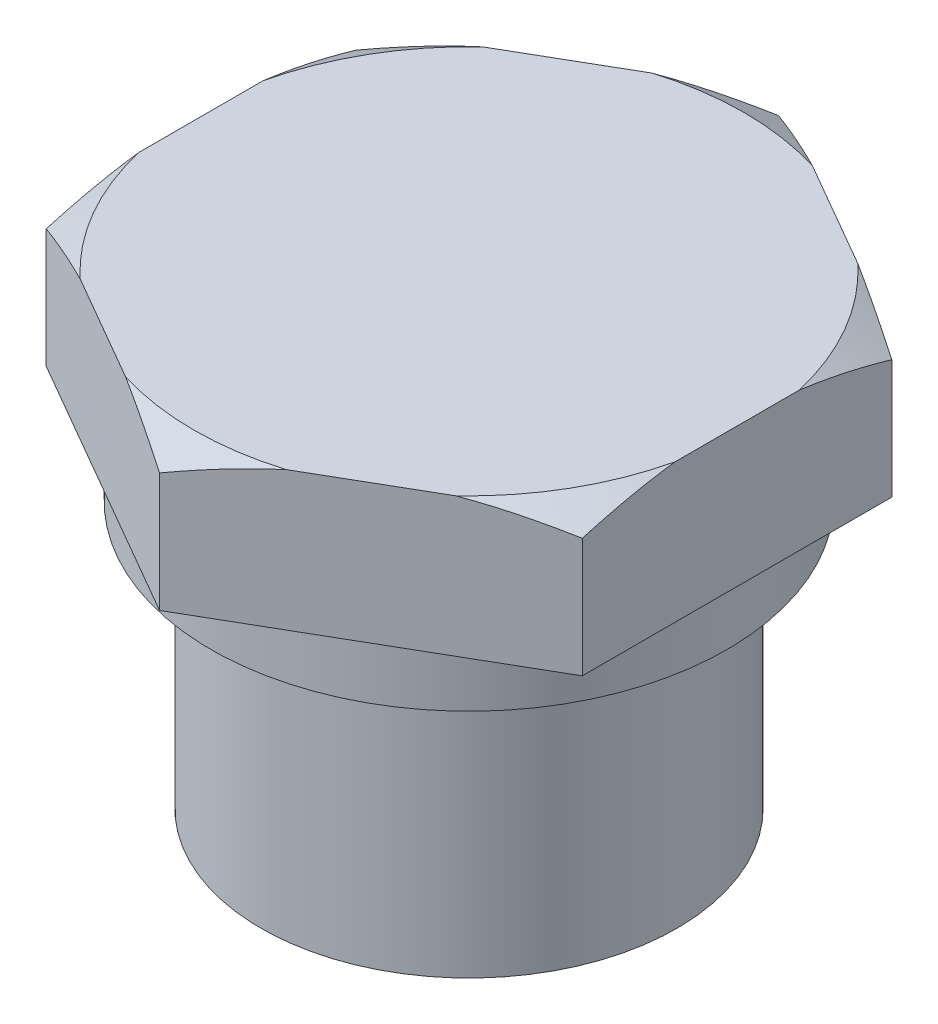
ISO-10303-21;
HEADER;
FILE_DESCRIPTION(('STEP AP214'),'2;1');
FILE_NAME('part.step','',(''),(''),'','','');
FILE_SCHEMA(('AUTOMOTIVE_DESIGN { 1 0 10303 214 1 1 1 1 }'));
ENDSEC;
DATA;
#1=APPLICATION_CONTEXT('core data for automotive mechanical design processes');
#2=APPLICATION_PROTOCOL_DEFINITION('international standard','automotive_design',2000,#1);
#3=PRODUCT_CONTEXT('',#1,'mechanical');
#4=PRODUCT('Part','Part','',(#3));
#5=PRODUCT_RELATED_PRODUCT_CATEGORY('part','',(#4));
#6=PRODUCT_DEFINITION_FORMATION('','',#4);
#7=PRODUCT_DEFINITION_CONTEXT('part definition',#1,'design');
#8=PRODUCT_DEFINITION('design','',#6,#7);
#9=PRODUCT_DEFINITION_SHAPE('','',#8);
#10=(LENGTH_UNIT() NAMED_UNIT(*) SI_UNIT(.MILLI.,.METRE.));
#11=(NAMED_UNIT(*) PLANE_ANGLE_UNIT() SI_UNIT($,.RADIAN.));
#12=(NAMED_UNIT(*) SI_UNIT($,.STERADIAN.) SOLID_ANGLE_UNIT());
#13=UNCERTAINTY_MEASURE_WITH_UNIT(LENGTH_MEASURE(1.E-05),#10,'distance_accuracy_value','');
#14=(GEOMETRIC_REPRESENTATION_CONTEXT(3) GLOBAL_UNCERTAINTY_ASSIGNED_CONTEXT((#13)) GLOBAL_UNIT_ASSIGNED_CONTEXT((#10,
#11,#12)) REPRESENTATION_CONTEXT('',''));
#15=CARTESIAN_POINT('',(0.,0.,0.));
#16=DIRECTION('',(0.,0.,1.));
#17=DIRECTION('',(1.,0.,0.));
#18=AXIS2_PLACEMENT_3D('',#15,#16,#17);
#19=CARTESIAN_POINT('',(0.,-3.,0.));
#20=DIRECTION('',(0.,-1.,0.));
#21=DIRECTION('',(0.,0.,-1.));
#22=AXIS2_PLACEMENT_3D('',#19,#20,#21);
#23=PLANE('',#22);
#24=CARTESIAN_POINT('',(0.,-3.,0.));
#25=DIRECTION('',(0.,-1.,0.));
#26=DIRECTION('',(0.,0.,-1.));
#27=AXIS2_PLACEMENT_3D('',#24,#25,#26);
#28=CIRCLE('',#27,13.);
#29=CARTESIAN_POINT('',(0.,-3.,-13.));
#30=VERTEX_POINT('',#29);
#31=EDGE_CURVE('E312',#30,#30,#28,.T.);
#32=ORIENTED_EDGE('',*,*,#31,.T.);
#33=EDGE_LOOP('',(#32));
#34=FACE_BOUND('',#33,.T.);
#35=CARTESIAN_POINT('',(0.,-3.,0.));
#36=DIRECTION('',(0.,-1.,0.));
#37=DIRECTION('',(0.,0.,-1.));
#38=AXIS2_PLACEMENT_3D('',#35,#36,#37);
#39=CIRCLE('',#38,10.4775);
#40=CARTESIAN_POINT('',(0.,-3.,-10.4775));
#41=VERTEX_POINT('',#40);
#42=EDGE_CURVE('E308',#41,#41,#39,.T.);
#43=ORIENTED_EDGE('',*,*,#42,.F.);
#44=EDGE_LOOP('',(#43));
#45=FACE_BOUND('',#44,.T.);
#46=ADVANCED_FACE('F32',(#34,#45),#23,.T.);
#47=CARTESIAN_POINT('',(-13.5,0.,-23.3826859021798));
#48=DIRECTION('',(0.,-1.,0.));
#49=DIRECTION('',(0.,0.,-1.));
#50=AXIS2_PLACEMENT_3D('',#47,#48,#49);
#51=PLANE('',#50);
#52=DIRECTION('',(-0.866025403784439,0.,-0.5));
#53=VECTOR('',#52,1.);
#54=CARTESIAN_POINT('',(0.,0.,-15.5884572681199));
#55=LINE('',#54,#53);
#56=CARTESIAN_POINT('',(13.5,0.,-7.79422863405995));
#57=VERTEX_POINT('',#56);
#58=CARTESIAN_POINT('',(0.,0.,-15.5884572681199));
#59=VERTEX_POINT('',#58);
#60=EDGE_CURVE('E141',#57,#59,#55,.T.);
#61=ORIENTED_EDGE('',*,*,#60,.F.);
#62=DIRECTION('',(0.,0.,-1.));
#63=VECTOR('',#62,1.);
#64=CARTESIAN_POINT('',(13.5,0.,-7.79422863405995));
#65=LINE('',#64,#63);
#66=CARTESIAN_POINT('',(13.5,0.,7.79422863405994));
#67=VERTEX_POINT('',#66);
#68=EDGE_CURVE('E147',#67,#57,#65,.T.);
#69=ORIENTED_EDGE('',*,*,#68,.F.);
#70=DIRECTION('',(0.866025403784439,0.,-0.5));
#71=VECTOR('',#70,1.);
#72=CARTESIAN_POINT('',(13.5,0.,7.79422863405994));
#73=LINE('',#72,#71);
#74=CARTESIAN_POINT('',(0.,0.,15.5884572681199));
#75=VERTEX_POINT('',#74);
#76=EDGE_CURVE('E152',#75,#67,#73,.T.);
#77=ORIENTED_EDGE('',*,*,#76,.F.);
#78=DIRECTION('',(0.866025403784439,0.,0.5));
#79=VECTOR('',#78,1.);
#80=CARTESIAN_POINT('',(-13.5,0.,7.79422863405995));
#81=LINE('',#80,#79);
#82=CARTESIAN_POINT('',(-13.5,0.,7.79422863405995));
#83=VERTEX_POINT('',#82);
#84=EDGE_CURVE('E323',#83,#75,#81,.T.);
#85=ORIENTED_EDGE('',*,*,#84,.F.);
#86=DIRECTION('',(0.,0.,1.));
#87=VECTOR('',#86,1.);
#88=CARTESIAN_POINT('',(-13.5,0.,-7.79422863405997));
#89=LINE('',#88,#87);
#90=CARTESIAN_POINT('',(-13.5,0.,-7.79422863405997));
#91=VERTEX_POINT('',#90);
#92=EDGE_CURVE('E329',#91,#83,#89,.T.);
#93=ORIENTED_EDGE('',*,*,#92,.F.);
#94=DIRECTION('',(-0.866025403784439,0.,0.5));
#95=VECTOR('',#94,1.);
#96=CARTESIAN_POINT('',(0.,0.,-15.5884572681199));
#97=LINE('',#96,#95);
#98=EDGE_CURVE('E337',#59,#91,#97,.T.);
#99=ORIENTED_EDGE('',*,*,#98,.F.);
#100=EDGE_LOOP('',(#61,#69,#77,#85,#93,#99));
#101=FACE_BOUND('',#100,.T.);
#102=CARTESIAN_POINT('',(0.,0.,0.));
#103=DIRECTION('',(0.,-1.,0.));
#104=DIRECTION('',(0.,0.,-1.));
#105=AXIS2_PLACEMENT_3D('',#102,#103,#104);
#106=CIRCLE('',#105,13.);
#107=CARTESIAN_POINT('',(0.,0.,-13.));
#108=VERTEX_POINT('',#107);
#109=EDGE_CURVE('E309',#108,#108,#106,.T.);
#110=ORIENTED_EDGE('',*,*,#109,.F.);
#111=EDGE_LOOP('',(#110));
#112=FACE_BOUND('',#111,.T.);
#113=ADVANCED_FACE('F225',(#101,#112),#51,.T.);
#114=CARTESIAN_POINT('',(0.,7.00000000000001,-15.5884572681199));
#115=DIRECTION('',(-0.499999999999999,0.,0.86602540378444));
#116=DIRECTION('',(0.866025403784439,0.,0.5));
#117=AXIS2_PLACEMENT_3D('',#114,#115,#116);
#118=PLANE('',#117);
#119=CARTESIAN_POINT('',(4.04716813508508,7.0002,-13.2518236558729));
#120=CARTESIAN_POINT('',(3.70446312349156,6.94877615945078,-13.449684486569));
#121=CARTESIAN_POINT('',(3.36286087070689,6.88815072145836,-13.64690863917));
#122=CARTESIAN_POINT('',(2.6826599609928,6.75038699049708,-14.0396228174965));
#123=CARTESIAN_POINT('',(2.34405768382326,6.67327262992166,-14.2351149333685));
#124=CARTESIAN_POINT('',(1.66975017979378,6.50428414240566,-14.6244265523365));
#125=CARTESIAN_POINT('',(1.334044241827,6.412413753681,-14.8182464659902));
#126=CARTESIAN_POINT('',(0.665004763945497,6.21555413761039,-15.2045165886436));
#127=CARTESIAN_POINT('',(0.331675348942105,6.11054616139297,-15.3969644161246));
#128=CARTESIAN_POINT('',(-0.000200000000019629,5.99993333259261,-15.5885727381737));
#129=B_SPLINE_CURVE_WITH_KNOTS('',3,(#119,#120,#121,#122,#123,#124,#125,#126,#127,#128),
.UNSPECIFIED.,.F.,.F.,(4,2,2,2,4),(0.,1.19692908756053,2.39213257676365,3.58703375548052,
4.783660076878),.UNSPECIFIED.);
#130=CARTESIAN_POINT('',(4.0458365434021,7.00000000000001,-13.2525924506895));
#131=VERTEX_POINT('',#130);
#132=CARTESIAN_POINT('',(0.,6.00000000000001,-15.5884572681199));
#133=VERTEX_POINT('',#132);
#134=EDGE_CURVE('E124',#131,#133,#129,.T.);
#135=ORIENTED_EDGE('',*,*,#134,.F.);
#136=DIRECTION('',(-0.866025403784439,0.,-0.5));
#137=VECTOR('',#136,1.);
#138=CARTESIAN_POINT('',(0.,7.00000000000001,-15.5884572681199));
#139=LINE('',#138,#137);
#140=CARTESIAN_POINT('',(9.45416345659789,7.00000000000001,-10.1300934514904));
#141=VERTEX_POINT('',#140);
#142=EDGE_CURVE('E139',#141,#131,#139,.T.);
#143=ORIENTED_EDGE('',*,*,#142,.F.);
#144=CARTESIAN_POINT('',(13.5002,5.99993333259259,-7.79411316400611));
#145=CARTESIAN_POINT('',(13.1683246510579,6.11054616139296,-7.98572148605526));
#146=CARTESIAN_POINT('',(12.8349952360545,6.21555413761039,-8.17816931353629));
#147=CARTESIAN_POINT('',(12.165955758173,6.412413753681,-8.56443943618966));
#148=CARTESIAN_POINT('',(11.8302498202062,6.50428414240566,-8.75825934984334));
#149=CARTESIAN_POINT('',(11.1559423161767,6.67327262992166,-9.14757096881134));
#150=CARTESIAN_POINT('',(10.8173400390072,6.75038699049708,-9.3430630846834));
#151=CARTESIAN_POINT('',(10.1371391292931,6.88815072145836,-9.73577726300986));
#152=CARTESIAN_POINT('',(9.79553687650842,6.94877615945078,-9.93300141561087));
#153=CARTESIAN_POINT('',(9.4528318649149,7.0002,-10.130862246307));
#154=B_SPLINE_CURVE_WITH_KNOTS('',3,(#144,#145,#146,#147,#148,#149,#150,#151,#152,#153),
.UNSPECIFIED.,.F.,.F.,(4,2,2,2,4),(0.,1.19662632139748,2.39152750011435,3.58673098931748,
4.78366007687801),.UNSPECIFIED.);
#155=CARTESIAN_POINT('',(13.5,6.00000000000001,-7.79422863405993));
#156=VERTEX_POINT('',#155);
#157=EDGE_CURVE('E239',#156,#141,#154,.T.);
#158=ORIENTED_EDGE('',*,*,#157,.F.);
#159=DIRECTION('',(0.,-1.,0.));
#160=VECTOR('',#159,1.);
#161=CARTESIAN_POINT('',(13.5,7.00000000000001,-7.79422863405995));
#162=LINE('',#161,#160);
#163=EDGE_CURVE('E166',#156,#57,#162,.T.);
#164=ORIENTED_EDGE('',*,*,#163,.T.);
#165=ORIENTED_EDGE('',*,*,#60,.T.);
#166=DIRECTION('',(0.,-1.,0.));
#167=VECTOR('',#166,1.);
#168=CARTESIAN_POINT('',(0.,7.00000000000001,-15.5884572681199));
#169=LINE('',#168,#167);
#170=EDGE_CURVE('E132',#133,#59,#169,.T.);
#171=ORIENTED_EDGE('',*,*,#170,.F.);
#172=EDGE_LOOP('',(#135,#143,#158,#164,#165,#171));
#173=FACE_BOUND('',#172,.T.);
#174=ADVANCED_FACE('F34',(#173),#118,.F.);
#175=CARTESIAN_POINT('',(0.,7.00000000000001,-15.5884572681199));
#176=DIRECTION('',(0.499999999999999,0.,0.86602540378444));
#177=DIRECTION('',(0.866025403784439,0.,-0.5));
#178=AXIS2_PLACEMENT_3D('',#175,#176,#177);
#179=PLANE('',#178);
#180=CARTESIAN_POINT('',(-9.45283186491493,7.0002,-10.130862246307));
#181=CARTESIAN_POINT('',(-9.79553687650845,6.94877615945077,-9.93300141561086));
#182=CARTESIAN_POINT('',(-10.1371391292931,6.88815072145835,-9.73577726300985));
#183=CARTESIAN_POINT('',(-10.8173400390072,6.75038699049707,-9.3430630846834));
#184=CARTESIAN_POINT('',(-11.1559423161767,6.67327262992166,-9.14757096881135));
#185=CARTESIAN_POINT('',(-11.8302498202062,6.50428414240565,-8.75825934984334));
#186=CARTESIAN_POINT('',(-12.165955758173,6.41241375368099,-8.56443943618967));
#187=CARTESIAN_POINT('',(-12.8349952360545,6.21555413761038,-8.1781693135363));
#188=CARTESIAN_POINT('',(-13.1683246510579,6.11054616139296,-7.98572148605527));
#189=CARTESIAN_POINT('',(-13.5002,5.99993333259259,-7.79411316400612));
#190=B_SPLINE_CURVE_WITH_KNOTS('',3,(#180,#181,#182,#183,#184,#185,#186,#187,#188,#189),
.UNSPECIFIED.,.F.,.F.,(4,2,2,2,4),(0.,1.19692908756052,2.39213257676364,3.5870337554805,
4.78366007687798),.UNSPECIFIED.);
#191=CARTESIAN_POINT('',(-9.4541634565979,7.00000000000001,-10.1300934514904));
#192=VERTEX_POINT('',#191);
#193=CARTESIAN_POINT('',(-13.5,6.00000000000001,-7.79422863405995));
#194=VERTEX_POINT('',#193);
#195=EDGE_CURVE('E193',#192,#194,#190,.T.);
#196=ORIENTED_EDGE('',*,*,#195,.F.);
#197=DIRECTION('',(-0.866025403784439,0.,0.5));
#198=VECTOR('',#197,1.);
#199=CARTESIAN_POINT('',(0.,7.00000000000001,-15.5884572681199));
#200=LINE('',#199,#198);
#201=CARTESIAN_POINT('',(-4.04583654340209,7.00000000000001,-13.2525924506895));
#202=VERTEX_POINT('',#201);
#203=EDGE_CURVE('E146',#202,#192,#200,.T.);
#204=ORIENTED_EDGE('',*,*,#203,.F.);
#205=CARTESIAN_POINT('',(0.000199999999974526,5.99993333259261,-15.5885727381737));
#206=CARTESIAN_POINT('',(-0.331675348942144,6.11054616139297,-15.3969644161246));
#207=CARTESIAN_POINT('',(-0.665004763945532,6.21555413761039,-15.2045165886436));
#208=CARTESIAN_POINT('',(-1.33404424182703,6.412413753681,-14.8182464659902));
#209=CARTESIAN_POINT('',(-1.6697501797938,6.50428414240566,-14.6244265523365));
#210=CARTESIAN_POINT('',(-2.34405768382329,6.67327262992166,-14.2351149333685));
#211=CARTESIAN_POINT('',(-2.68265996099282,6.75038699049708,-14.0396228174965));
#212=CARTESIAN_POINT('',(-3.3628608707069,6.88815072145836,-13.64690863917));
#213=CARTESIAN_POINT('',(-3.70446312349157,6.94877615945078,-13.449684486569));
#214=CARTESIAN_POINT('',(-4.04716813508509,7.0002,-13.2518236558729));
#215=B_SPLINE_CURVE_WITH_KNOTS('',3,(#205,#206,#207,#208,#209,#210,#211,#212,#213,#214),
.UNSPECIFIED.,.F.,.F.,(4,2,2,2,4),(0.,1.19662632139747,2.39152750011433,3.58673098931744,
4.78366007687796),.UNSPECIFIED.);
#216=EDGE_CURVE('E126',#133,#202,#215,.T.);
#217=ORIENTED_EDGE('',*,*,#216,.F.);
#218=ORIENTED_EDGE('',*,*,#170,.T.);
#219=ORIENTED_EDGE('',*,*,#98,.T.);
#220=DIRECTION('',(0.,-1.,0.));
#221=VECTOR('',#220,1.);
#222=CARTESIAN_POINT('',(-13.5,7.00000000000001,-7.79422863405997));
#223=LINE('',#222,#221);
#224=EDGE_CURVE('E174',#194,#91,#223,.T.);
#225=ORIENTED_EDGE('',*,*,#224,.F.);
#226=EDGE_LOOP('',(#196,#204,#217,#218,#219,#225));
#227=FACE_BOUND('',#226,.T.);
#228=ADVANCED_FACE('F199',(#227),#179,.F.);
#229=CARTESIAN_POINT('',(-13.5,7.00000000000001,-7.79422863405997));
#230=DIRECTION('',(1.,0.,0.));
#231=DIRECTION('',(0.,0.,-1.));
#232=AXIS2_PLACEMENT_3D('',#229,#230,#231);
#233=PLANE('',#232);
#234=CARTESIAN_POINT('',(-13.5,0.731854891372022,-20.6999974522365));
#235=CARTESIAN_POINT('',(-13.5,0.875220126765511,-20.4035338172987));
#236=CARTESIAN_POINT('',(-13.5,1.01784567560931,-20.1067126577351));
#237=CARTESIAN_POINT('',(-13.5,1.30144767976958,-19.5122797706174));
#238=CARTESIAN_POINT('',(-13.5,1.442424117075,-19.2146680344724));
#239=CARTESIAN_POINT('',(-13.5,1.8626658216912,-18.3204469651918));
#240=CARTESIAN_POINT('',(-13.5,2.13919698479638,-17.722547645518));
#241=CARTESIAN_POINT('',(-13.5,2.68476507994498,-16.5192201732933));
#242=CARTESIAN_POINT('',(-13.5,2.95375033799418,-15.9137685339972));
#243=CARTESIAN_POINT('',(-13.5,3.48021293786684,-14.6979001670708));
#244=CARTESIAN_POINT('',(-13.5,3.73769087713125,-14.0874836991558));
#245=CARTESIAN_POINT('',(-13.5,4.24118383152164,-12.8530045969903));
#246=CARTESIAN_POINT('',(-13.5,4.48701541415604,-12.2288667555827));
#247=CARTESIAN_POINT('',(-13.5,4.95949719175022,-10.9732351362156));
#248=CARTESIAN_POINT('',(-13.5,5.18614525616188,-10.341740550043));
#249=CARTESIAN_POINT('',(-13.5,5.61418777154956,-9.07169903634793));
#250=CARTESIAN_POINT('',(-13.5,5.81563566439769,-8.43317026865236));
#251=CARTESIAN_POINT('',(-13.5,6.18676403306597,-7.14697254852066));
#252=CARTESIAN_POINT('',(-13.5,6.35645452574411,-6.49930654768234));
#253=CARTESIAN_POINT('',(-13.5,6.58097291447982,-5.52083361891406));
#254=CARTESIAN_POINT('',(-13.5,6.65081993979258,-5.19345056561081));
#255=CARTESIAN_POINT('',(-13.5,6.77940909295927,-4.53649957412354));
#256=CARTESIAN_POINT('',(-13.5,6.83815146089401,-4.20693168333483));
#257=CARTESIAN_POINT('',(-13.5,6.94349253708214,-3.54582359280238));
#258=CARTESIAN_POINT('',(-13.5,6.99009025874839,-3.21428323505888));
#259=CARTESIAN_POINT('',(-13.5,7.0702038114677,-2.54962823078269));
#260=CARTESIAN_POINT('',(-13.5,7.1037201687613,-2.21651364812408));
#261=CARTESIAN_POINT('',(-13.5,7.15677043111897,-1.55130709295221));
#262=CARTESIAN_POINT('',(-13.5,7.17639228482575,-1.21922218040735));
#263=CARTESIAN_POINT('',(-13.5,7.20154893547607,-0.554520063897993));
#264=CARTESIAN_POINT('',(-13.5,7.20708391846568,-0.22190286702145));
#265=CARTESIAN_POINT('',(-13.5,7.20393536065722,0.443171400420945));
#266=CARTESIAN_POINT('',(-13.5,7.19525584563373,0.775628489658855));
#267=CARTESIAN_POINT('',(-13.5,7.16389479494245,1.43988636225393));
#268=CARTESIAN_POINT('',(-13.5,7.14121254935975,1.7716871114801));
#269=CARTESIAN_POINT('',(-13.5,7.06982442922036,2.57495493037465));
#270=CARTESIAN_POINT('',(-13.5,7.01415381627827,3.04581322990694));
#271=CARTESIAN_POINT('',(-13.5,6.87769665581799,3.98394094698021));
#272=CARTESIAN_POINT('',(-13.5,6.79690327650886,4.45120935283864));
#273=CARTESIAN_POINT('',(-13.5,6.61306566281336,5.38176539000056));
#274=CARTESIAN_POINT('',(-13.5,6.51000046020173,5.84504883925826));
#275=CARTESIAN_POINT('',(-13.5,6.28476584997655,6.76685819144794));
#276=CARTESIAN_POINT('',(-13.5,6.1625982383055,7.22538453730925));
#277=CARTESIAN_POINT('',(-13.5,5.89887719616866,8.14901262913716));
#278=CARTESIAN_POINT('',(-13.5,5.75692068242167,8.61399850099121));
#279=CARTESIAN_POINT('',(-13.5,5.45892506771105,9.53905503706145));
#280=CARTESIAN_POINT('',(-13.5,5.3028956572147,9.99912884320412));
#281=CARTESIAN_POINT('',(-13.5,4.9799624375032,10.912520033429));
#282=CARTESIAN_POINT('',(-13.5,4.81312467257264,11.3658608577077));
#283=CARTESIAN_POINT('',(-13.5,4.55555375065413,12.0431805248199));
#284=CARTESIAN_POINT('',(-13.5,4.4684583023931,12.2685531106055));
#285=CARTESIAN_POINT('',(-13.5,4.29204351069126,12.718420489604));
#286=CARTESIAN_POINT('',(-13.5,4.20272421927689,12.9429153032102));
#287=CARTESIAN_POINT('',(-13.5,4.11239297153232,13.1670027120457));
#288=B_SPLINE_CURVE_WITH_KNOTS('',3,(#234,#235,#236,#237,#238,#239,#240,#241,#242,#243,#244,
#245,#246,#247,#248,#249,#250,#251,#252,#253,#254,#255,#256,#257,#258,#259,#260,#261,#262,#263,
#264,#265,#266,#267,#268,#269,#270,#271,#272,#273,#274,#275,#276,#277,#278,#279,#280,#281,#282,
#283,#284,#285,#286,#287),.UNSPECIFIED.,.F.,.F.,(4,2,2,2,2,2,2,2,2,2,2,2,2,2,2,2,2,2,2,2,2,2,2,
2,2,2,4),(0.,0.98792444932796,1.97585967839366,3.95204978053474,5.93949903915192,
7.92684499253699,9.93902333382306,11.9514248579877,13.9594836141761,15.966907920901,
16.971003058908,17.975076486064,18.9792314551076,19.9833460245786,20.9810465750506,
21.9787339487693,22.9761388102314,23.9735942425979,25.395216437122,26.8172255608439,
28.2405793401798,29.6637993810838,31.1220437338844,32.5792915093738,34.0283493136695,
34.7531886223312,35.4780109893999),.UNSPECIFIED.);
#289=CARTESIAN_POINT('',(-13.5,7.00000000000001,-3.12249899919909));
#290=VERTEX_POINT('',#289);
#291=EDGE_CURVE('E195',#194,#290,#288,.T.);
#292=ORIENTED_EDGE('',*,*,#291,.F.);
#293=ORIENTED_EDGE('',*,*,#224,.T.);
#294=ORIENTED_EDGE('',*,*,#92,.T.);
#295=DIRECTION('',(0.,-1.,0.));
#296=VECTOR('',#295,1.);
#297=CARTESIAN_POINT('',(-13.5,7.00000000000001,7.79422863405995));
#298=LINE('',#297,#296);
#299=CARTESIAN_POINT('',(-13.5,6.00000000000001,7.79422863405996));
#300=VERTEX_POINT('',#299);
#301=EDGE_CURVE('E172',#300,#83,#298,.T.);
#302=ORIENTED_EDGE('',*,*,#301,.F.);
#303=CARTESIAN_POINT('',(-13.5,7.00000000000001,3.12249899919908));
#304=VERTEX_POINT('',#303);
#305=EDGE_CURVE('E203',#304,#300,#288,.T.);
#306=ORIENTED_EDGE('',*,*,#305,.F.);
#307=DIRECTION('',(0.,0.,1.));
#308=VECTOR('',#307,1.);
#309=CARTESIAN_POINT('',(-13.5,7.00000000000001,-7.79422863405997));
#310=LINE('',#309,#308);
#311=EDGE_CURVE('E149',#290,#304,#310,.T.);
#312=ORIENTED_EDGE('',*,*,#311,.F.);
#313=EDGE_LOOP('',(#292,#293,#294,#302,#306,#312));
#314=FACE_BOUND('',#313,.T.);
#315=ADVANCED_FACE('F272',(#314),#233,.F.);
#316=CARTESIAN_POINT('',(-13.5,7.00000000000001,7.79422863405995));
#317=DIRECTION('',(0.5,0.,-0.86602540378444));
#318=DIRECTION('',(-0.866025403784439,0.,-0.5));
#319=AXIS2_PLACEMENT_3D('',#316,#317,#318);
#320=PLANE('',#319);
#321=CARTESIAN_POINT('',(-4.04716813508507,7.0002,13.2518236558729));
#322=CARTESIAN_POINT('',(-3.70446312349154,6.94877615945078,13.449684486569));
#323=CARTESIAN_POINT('',(-3.36286087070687,6.88815072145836,13.64690863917));
#324=CARTESIAN_POINT('',(-2.68265996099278,6.75038699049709,14.0396228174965));
#325=CARTESIAN_POINT('',(-2.34405768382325,6.67327262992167,14.2351149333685));
#326=CARTESIAN_POINT('',(-1.66975017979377,6.50428414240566,14.6244265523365));
#327=CARTESIAN_POINT('',(-1.334044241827,6.412413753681,14.8182464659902));
#328=CARTESIAN_POINT('',(-0.665004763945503,6.2155541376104,15.2045165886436));
#329=CARTESIAN_POINT('',(-0.331675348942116,6.11054616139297,15.3969644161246));
#330=CARTESIAN_POINT('',(0.000199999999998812,5.99993333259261,15.5885727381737));
#331=B_SPLINE_CURVE_WITH_KNOTS('',3,(#321,#322,#323,#324,#325,#326,#327,#328,#329,#330),
.UNSPECIFIED.,.F.,.F.,(4,2,2,2,4),(0.,1.19692908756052,2.39213257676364,3.58703375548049,
4.78366007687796),.UNSPECIFIED.);
#332=CARTESIAN_POINT('',(-4.04583654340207,7.00000000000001,13.2525924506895));
#333=VERTEX_POINT('',#332);
#334=CARTESIAN_POINT('',(0.,6.00000000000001,15.5884572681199));
#335=VERTEX_POINT('',#334);
#336=EDGE_CURVE('E257',#333,#335,#331,.T.);
#337=ORIENTED_EDGE('',*,*,#336,.F.);
#338=DIRECTION('',(0.866025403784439,0.,0.5));
#339=VECTOR('',#338,1.);
#340=CARTESIAN_POINT('',(-13.5,7.00000000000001,7.79422863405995));
#341=LINE('',#340,#339);
#342=CARTESIAN_POINT('',(-9.45416345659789,7.00000000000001,10.1300934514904));
#343=VERTEX_POINT('',#342);
#344=EDGE_CURVE('E158',#343,#333,#341,.T.);
#345=ORIENTED_EDGE('',*,*,#344,.F.);
#346=CARTESIAN_POINT('',(-13.5002,5.99993333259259,7.79411316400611));
#347=CARTESIAN_POINT('',(-13.1683246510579,6.11054616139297,7.98572148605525));
#348=CARTESIAN_POINT('',(-12.8349952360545,6.21555413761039,8.17816931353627));
#349=CARTESIAN_POINT('',(-12.165955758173,6.412413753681,8.56443943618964));
#350=CARTESIAN_POINT('',(-11.8302498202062,6.50428414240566,8.75825934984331));
#351=CARTESIAN_POINT('',(-11.1559423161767,6.67327262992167,9.14757096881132));
#352=CARTESIAN_POINT('',(-10.8173400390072,6.75038699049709,9.34306308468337));
#353=CARTESIAN_POINT('',(-10.1371391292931,6.88815072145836,9.73577726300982));
#354=CARTESIAN_POINT('',(-9.79553687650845,6.94877615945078,9.93300141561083));
#355=CARTESIAN_POINT('',(-9.45283186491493,7.0002,10.130862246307));
#356=B_SPLINE_CURVE_WITH_KNOTS('',3,(#346,#347,#348,#349,#350,#351,#352,#353,#354,#355),
.UNSPECIFIED.,.F.,.F.,(4,2,2,2,4),(0.,1.19662632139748,2.39152750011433,3.58673098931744,
4.78366007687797),.UNSPECIFIED.);
#357=EDGE_CURVE('E263',#300,#343,#356,.T.);
#358=ORIENTED_EDGE('',*,*,#357,.F.);
#359=ORIENTED_EDGE('',*,*,#301,.T.);
#360=ORIENTED_EDGE('',*,*,#84,.T.);
#361=DIRECTION('',(0.,-1.,0.));
#362=VECTOR('',#361,1.);
#363=CARTESIAN_POINT('',(0.,7.00000000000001,15.5884572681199));
#364=LINE('',#363,#362);
#365=EDGE_CURVE('E170',#335,#75,#364,.T.);
#366=ORIENTED_EDGE('',*,*,#365,.F.);
#367=EDGE_LOOP('',(#337,#345,#358,#359,#360,#366));
#368=FACE_BOUND('',#367,.T.);
#369=ADVANCED_FACE('F268',(#368),#320,.F.);
#370=CARTESIAN_POINT('',(13.5,7.00000000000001,7.79422863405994));
#371=DIRECTION('',(-0.499999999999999,0.,-0.86602540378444));
#372=DIRECTION('',(-0.866025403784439,0.,0.5));
#373=AXIS2_PLACEMENT_3D('',#370,#371,#372);
#374=PLANE('',#373);
#375=CARTESIAN_POINT('',(9.45283186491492,7.0002,10.130862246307));
#376=CARTESIAN_POINT('',(9.79553687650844,6.94877615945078,9.93300141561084));
#377=CARTESIAN_POINT('',(10.1371391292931,6.88815072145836,9.73577726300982));
#378=CARTESIAN_POINT('',(10.8173400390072,6.75038699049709,9.34306308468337));
#379=CARTESIAN_POINT('',(11.1559423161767,6.67327262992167,9.14757096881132));
#380=CARTESIAN_POINT('',(11.8302498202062,6.50428414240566,8.75825934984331));
#381=CARTESIAN_POINT('',(12.165955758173,6.412413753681,8.56443943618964));
#382=CARTESIAN_POINT('',(12.8349952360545,6.21555413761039,8.17816931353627));
#383=CARTESIAN_POINT('',(13.1683246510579,6.11054616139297,7.98572148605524));
#384=CARTESIAN_POINT('',(13.5002,5.99993333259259,7.79411316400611));
#385=B_SPLINE_CURVE_WITH_KNOTS('',3,(#375,#376,#377,#378,#379,#380,#381,#382,#383,#384),
.UNSPECIFIED.,.F.,.F.,(4,2,2,2,4),(0.,1.19692908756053,2.39213257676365,3.5870337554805,
4.78366007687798),.UNSPECIFIED.);
#386=CARTESIAN_POINT('',(9.45416345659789,7.00000000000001,10.1300934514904));
#387=VERTEX_POINT('',#386);
#388=CARTESIAN_POINT('',(13.5,6.00000000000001,7.79422863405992));
#389=VERTEX_POINT('',#388);
#390=EDGE_CURVE('E245',#387,#389,#385,.T.);
#391=ORIENTED_EDGE('',*,*,#390,.F.);
#392=DIRECTION('',(0.866025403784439,0.,-0.5));
#393=VECTOR('',#392,1.);
#394=CARTESIAN_POINT('',(13.5,7.00000000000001,7.79422863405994));
#395=LINE('',#394,#393);
#396=CARTESIAN_POINT('',(4.04583654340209,7.00000000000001,13.2525924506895));
#397=VERTEX_POINT('',#396);
#398=EDGE_CURVE('E161',#397,#387,#395,.T.);
#399=ORIENTED_EDGE('',*,*,#398,.F.);
#400=CARTESIAN_POINT('',(-0.000200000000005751,5.99993333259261,15.5885727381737));
#401=CARTESIAN_POINT('',(0.331675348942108,6.11054616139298,15.3969644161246));
#402=CARTESIAN_POINT('',(0.665004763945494,6.2155541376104,15.2045165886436));
#403=CARTESIAN_POINT('',(1.334044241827,6.41241375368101,14.8182464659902));
#404=CARTESIAN_POINT('',(1.66975017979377,6.50428414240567,14.6244265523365));
#405=CARTESIAN_POINT('',(2.34405768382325,6.67327262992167,14.2351149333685));
#406=CARTESIAN_POINT('',(2.68265996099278,6.75038699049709,14.0396228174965));
#407=CARTESIAN_POINT('',(3.36286087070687,6.88815072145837,13.64690863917));
#408=CARTESIAN_POINT('',(3.70446312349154,6.94877615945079,13.449684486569));
#409=CARTESIAN_POINT('',(4.04716813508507,7.0002,13.2518236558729));
#410=B_SPLINE_CURVE_WITH_KNOTS('',3,(#400,#401,#402,#403,#404,#405,#406,#407,#408,#409),
.UNSPECIFIED.,.F.,.F.,(4,2,2,2,4),(0.,1.19662632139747,2.39152750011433,3.58673098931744,
4.78366007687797),.UNSPECIFIED.);
#411=EDGE_CURVE('E56',#335,#397,#410,.T.);
#412=ORIENTED_EDGE('',*,*,#411,.F.);
#413=ORIENTED_EDGE('',*,*,#365,.T.);
#414=ORIENTED_EDGE('',*,*,#76,.T.);
#415=DIRECTION('',(0.,-1.,0.));
#416=VECTOR('',#415,1.);
#417=CARTESIAN_POINT('',(13.5,7.00000000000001,7.79422863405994));
#418=LINE('',#417,#416);
#419=EDGE_CURVE('E168',#389,#67,#418,.T.);
#420=ORIENTED_EDGE('',*,*,#419,.F.);
#421=EDGE_LOOP('',(#391,#399,#412,#413,#414,#420));
#422=FACE_BOUND('',#421,.T.);
#423=ADVANCED_FACE('F271',(#422),#374,.F.);
#424=CARTESIAN_POINT('',(13.5,7.00000000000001,-7.79422863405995));
#425=DIRECTION('',(-1.,0.,0.));
#426=DIRECTION('',(0.,0.,1.));
#427=AXIS2_PLACEMENT_3D('',#424,#425,#426);
#428=PLANE('',#427);
#429=CARTESIAN_POINT('',(13.5,0.731854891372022,-20.6999974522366));
#430=CARTESIAN_POINT('',(13.5,0.875220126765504,-20.4035338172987));
#431=CARTESIAN_POINT('',(13.5,1.0178456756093,-20.1067126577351));
#432=CARTESIAN_POINT('',(13.5,1.30144767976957,-19.5122797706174));
#433=CARTESIAN_POINT('',(13.5,1.44242411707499,-19.2146680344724));
#434=CARTESIAN_POINT('',(13.5,1.86266582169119,-18.3204469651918));
#435=CARTESIAN_POINT('',(13.5,2.13919698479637,-17.722547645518));
#436=CARTESIAN_POINT('',(13.5,2.68476507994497,-16.5192201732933));
#437=CARTESIAN_POINT('',(13.5,2.95375033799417,-15.9137685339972));
#438=CARTESIAN_POINT('',(13.5,3.48021293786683,-14.6979001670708));
#439=CARTESIAN_POINT('',(13.5,3.73769087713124,-14.0874836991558));
#440=CARTESIAN_POINT('',(13.5,4.24118383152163,-12.8530045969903));
#441=CARTESIAN_POINT('',(13.5,4.48701541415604,-12.2288667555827));
#442=CARTESIAN_POINT('',(13.5,4.95949719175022,-10.9732351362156));
#443=CARTESIAN_POINT('',(13.5,5.18614525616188,-10.341740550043));
#444=CARTESIAN_POINT('',(13.5,5.61418777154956,-9.07169903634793));
#445=CARTESIAN_POINT('',(13.5,5.81563566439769,-8.43317026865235));
#446=CARTESIAN_POINT('',(13.5,6.18676403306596,-7.14697254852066));
#447=CARTESIAN_POINT('',(13.5,6.35645452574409,-6.49930654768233));
#448=CARTESIAN_POINT('',(13.5,6.58097291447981,-5.52083361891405));
#449=CARTESIAN_POINT('',(13.5,6.65081993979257,-5.1934505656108));
#450=CARTESIAN_POINT('',(13.5,6.77940909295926,-4.53649957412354));
#451=CARTESIAN_POINT('',(13.5,6.838151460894,-4.20693168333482));
#452=CARTESIAN_POINT('',(13.5,6.94349253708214,-3.54582359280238));
#453=CARTESIAN_POINT('',(13.5,6.99009025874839,-3.21428323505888));
#454=CARTESIAN_POINT('',(13.5,7.0702038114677,-2.54962823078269));
#455=CARTESIAN_POINT('',(13.5,7.1037201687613,-2.21651364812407));
#456=CARTESIAN_POINT('',(13.5,7.15677043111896,-1.5513070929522));
#457=CARTESIAN_POINT('',(13.5,7.17639228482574,-1.21922218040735));
#458=CARTESIAN_POINT('',(13.5,7.20154893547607,-0.554520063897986));
#459=CARTESIAN_POINT('',(13.5,7.20708391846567,-0.221902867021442));
#460=CARTESIAN_POINT('',(13.5,7.20393536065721,0.443171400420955));
#461=CARTESIAN_POINT('',(13.5,7.19525584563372,0.775628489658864));
#462=CARTESIAN_POINT('',(13.5,7.16389479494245,1.43988636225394));
#463=CARTESIAN_POINT('',(13.5,7.14121254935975,1.77168711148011));
#464=CARTESIAN_POINT('',(13.5,7.06982442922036,2.57495493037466));
#465=CARTESIAN_POINT('',(13.5,7.01415381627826,3.04581322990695));
#466=CARTESIAN_POINT('',(13.5,6.87769665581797,3.98394094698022));
#467=CARTESIAN_POINT('',(13.5,6.79690327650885,4.45120935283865));
#468=CARTESIAN_POINT('',(13.5,6.61306566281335,5.38176539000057));
#469=CARTESIAN_POINT('',(13.5,6.51000046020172,5.84504883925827));
#470=CARTESIAN_POINT('',(13.5,6.28476584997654,6.76685819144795));
#471=CARTESIAN_POINT('',(13.5,6.16259823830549,7.22538453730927));
#472=CARTESIAN_POINT('',(13.5,5.89887719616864,8.14901262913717));
#473=CARTESIAN_POINT('',(13.5,5.75692068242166,8.61399850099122));
#474=CARTESIAN_POINT('',(13.5,5.45892506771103,9.53905503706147));
#475=CARTESIAN_POINT('',(13.5,5.30289565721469,9.99912884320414));
#476=CARTESIAN_POINT('',(13.5,4.97996243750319,10.912520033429));
#477=CARTESIAN_POINT('',(13.5,4.81312467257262,11.3658608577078));
#478=CARTESIAN_POINT('',(13.5,4.55555375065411,12.0431805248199));
#479=CARTESIAN_POINT('',(13.5,4.46845830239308,12.2685531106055));
#480=CARTESIAN_POINT('',(13.5,4.29204351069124,12.718420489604));
#481=CARTESIAN_POINT('',(13.5,4.20272421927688,12.9429153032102));
#482=CARTESIAN_POINT('',(13.5,4.11239297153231,13.1670027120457));
#483=B_SPLINE_CURVE_WITH_KNOTS('',3,(#429,#430,#431,#432,#433,#434,#435,#436,#437,#438,#439,
#440,#441,#442,#443,#444,#445,#446,#447,#448,#449,#450,#451,#452,#453,#454,#455,#456,#457,#458,
#459,#460,#461,#462,#463,#464,#465,#466,#467,#468,#469,#470,#471,#472,#473,#474,#475,#476,#477,
#478,#479,#480,#481,#482),.UNSPECIFIED.,.F.,.F.,(4,2,2,2,2,2,2,2,2,2,2,2,2,2,2,2,2,2,2,2,2,2,2,
2,2,2,4),(0.,0.987924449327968,1.97585967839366,3.95204978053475,5.93949903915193,
7.926844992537,9.93902333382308,11.9514248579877,13.9594836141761,15.966907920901,
16.971003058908,17.975076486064,18.9792314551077,19.9833460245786,20.9810465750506,
21.9787339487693,22.9761388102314,23.9735942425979,25.395216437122,26.8172255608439,
28.2405793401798,29.6637993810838,31.1220437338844,32.5792915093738,34.0283493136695,
34.7531886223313,35.4780109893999),.UNSPECIFIED.);
#484=CARTESIAN_POINT('',(13.5,7.00000000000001,3.12249899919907));
#485=VERTEX_POINT('',#484);
#486=EDGE_CURVE('E48',#389,#485,#483,.F.);
#487=ORIENTED_EDGE('',*,*,#486,.F.);
#488=ORIENTED_EDGE('',*,*,#419,.T.);
#489=ORIENTED_EDGE('',*,*,#68,.T.);
#490=ORIENTED_EDGE('',*,*,#163,.F.);
#491=CARTESIAN_POINT('',(13.5,7.00000000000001,-3.12249899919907));
#492=VERTEX_POINT('',#491);
#493=EDGE_CURVE('E230',#492,#156,#483,.F.);
#494=ORIENTED_EDGE('',*,*,#493,.F.);
#495=DIRECTION('',(0.,0.,-1.));
#496=VECTOR('',#495,1.);
#497=CARTESIAN_POINT('',(13.5,7.00000000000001,-7.79422863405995));
#498=LINE('',#497,#496);
#499=EDGE_CURVE('E164',#485,#492,#498,.T.);
#500=ORIENTED_EDGE('',*,*,#499,.F.);
#501=EDGE_LOOP('',(#487,#488,#489,#490,#494,#500));
#502=FACE_BOUND('',#501,.T.);
#503=ADVANCED_FACE('F363',(#502),#428,.F.);
#504=CARTESIAN_POINT('',(-13.5,7.00000000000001,-23.3826859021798));
#505=DIRECTION('',(0.,-1.,0.));
#506=DIRECTION('',(0.,0.,-1.));
#507=AXIS2_PLACEMENT_3D('',#504,#505,#506);
#508=PLANE('',#507);
#509=CARTESIAN_POINT('',(0.,7.00000000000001,0.));
#510=DIRECTION('',(0.,-1.,0.));
#511=DIRECTION('',(0.,0.,-1.));
#512=AXIS2_PLACEMENT_3D('',#509,#510,#511);
#513=CIRCLE('',#512,13.856406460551);
#514=EDGE_CURVE('E134',#141,#492,#513,.T.);
#515=ORIENTED_EDGE('',*,*,#514,.F.);
#516=ORIENTED_EDGE('',*,*,#142,.T.);
#517=EDGE_CURVE('E121',#202,#131,#513,.T.);
#518=ORIENTED_EDGE('',*,*,#517,.F.);
#519=ORIENTED_EDGE('',*,*,#203,.T.);
#520=EDGE_CURVE('E131',#290,#192,#513,.T.);
#521=ORIENTED_EDGE('',*,*,#520,.F.);
#522=ORIENTED_EDGE('',*,*,#311,.T.);
#523=EDGE_CURVE('E184',#343,#304,#513,.T.);
#524=ORIENTED_EDGE('',*,*,#523,.F.);
#525=ORIENTED_EDGE('',*,*,#344,.T.);
#526=EDGE_CURVE('E182',#397,#333,#513,.T.);
#527=ORIENTED_EDGE('',*,*,#526,.F.);
#528=ORIENTED_EDGE('',*,*,#398,.T.);
#529=EDGE_CURVE('E179',#485,#387,#513,.T.);
#530=ORIENTED_EDGE('',*,*,#529,.F.);
#531=ORIENTED_EDGE('',*,*,#499,.T.);
#532=EDGE_LOOP('',(#515,#516,#518,#519,#521,#522,#524,#525,#527,#528,#530,#531));
#533=FACE_BOUND('',#532,.T.);
#534=ADVANCED_FACE('F144',(#533),#508,.F.);
#535=CARTESIAN_POINT('',(0.,6.00000000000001,0.));
#536=DIRECTION('',(0.,-1.,0.));
#537=DIRECTION('',(0.,0.,-1.));
#538=AXIS2_PLACEMENT_3D('',#535,#536,#537);
#539=CONICAL_SURFACE('',#538,15.5884572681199,1.0471975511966);
#540=ORIENTED_EDGE('',*,*,#134,.T.);
#541=ORIENTED_EDGE('',*,*,#216,.T.);
#542=ORIENTED_EDGE('',*,*,#517,.T.);
#543=EDGE_LOOP('',(#540,#541,#542));
#544=FACE_BOUND('',#543,.T.);
#545=ADVANCED_FACE('F123',(#544),#539,.T.);
#546=ORIENTED_EDGE('',*,*,#195,.T.);
#547=ORIENTED_EDGE('',*,*,#291,.T.);
#548=ORIENTED_EDGE('',*,*,#520,.T.);
#549=EDGE_LOOP('',(#546,#547,#548));
#550=FACE_BOUND('',#549,.T.);
#551=ADVANCED_FACE('F192',(#550),#539,.T.);
#552=ORIENTED_EDGE('',*,*,#305,.T.);
#553=ORIENTED_EDGE('',*,*,#357,.T.);
#554=ORIENTED_EDGE('',*,*,#523,.T.);
#555=EDGE_LOOP('',(#552,#553,#554));
#556=FACE_BOUND('',#555,.T.);
#557=ADVANCED_FACE('F344',(#556),#539,.T.);
#558=ORIENTED_EDGE('',*,*,#336,.T.);
#559=ORIENTED_EDGE('',*,*,#411,.T.);
#560=ORIENTED_EDGE('',*,*,#526,.T.);
#561=EDGE_LOOP('',(#558,#559,#560));
#562=FACE_BOUND('',#561,.T.);
#563=ADVANCED_FACE('F315',(#562),#539,.T.);
#564=ORIENTED_EDGE('',*,*,#390,.T.);
#565=ORIENTED_EDGE('',*,*,#486,.T.);
#566=ORIENTED_EDGE('',*,*,#529,.T.);
#567=EDGE_LOOP('',(#564,#565,#566));
#568=FACE_BOUND('',#567,.T.);
#569=ADVANCED_FACE('F350',(#568),#539,.T.);
#570=ORIENTED_EDGE('',*,*,#157,.T.);
#571=ORIENTED_EDGE('',*,*,#514,.T.);
#572=ORIENTED_EDGE('',*,*,#493,.T.);
#573=EDGE_LOOP('',(#570,#571,#572));
#574=FACE_BOUND('',#573,.T.);
#575=ADVANCED_FACE('F222',(#574),#539,.T.);
#576=CARTESIAN_POINT('',(0.,-3.,0.));
#577=DIRECTION('',(0.,1.,0.));
#578=DIRECTION('',(0.,0.,1.));
#579=AXIS2_PLACEMENT_3D('',#576,#577,#578);
#580=CYLINDRICAL_SURFACE('',#579,13.);
#581=ORIENTED_EDGE('',*,*,#31,.F.);
#582=EDGE_LOOP('',(#581));
#583=FACE_BOUND('',#582,.T.);
#584=ORIENTED_EDGE('',*,*,#109,.T.);
#585=EDGE_LOOP('',(#584));
#586=FACE_BOUND('',#585,.T.);
#587=ADVANCED_FACE('F223',(#583,#586),#580,.T.);
#588=CARTESIAN_POINT('',(0.,-4.99999999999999,0.));
#589=DIRECTION('',(0.,1.,0.));
#590=DIRECTION('',(0.,0.,1.));
#591=AXIS2_PLACEMENT_3D('',#588,#589,#590);
#592=CYLINDRICAL_SURFACE('',#591,10.4775);
#593=CARTESIAN_POINT('',(0.,-16.4226497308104,0.));
#594=DIRECTION('',(0.,-1.,0.));
#595=DIRECTION('',(0.,0.,-1.));
#596=AXIS2_PLACEMENT_3D('',#593,#594,#595);
#597=CIRCLE('',#596,10.4775);
#598=CARTESIAN_POINT('',(0.,-16.4226497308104,-10.4775));
#599=VERTEX_POINT('',#598);
#600=EDGE_CURVE('E11',#599,#599,#597,.F.);
#601=ORIENTED_EDGE('',*,*,#600,.T.);
#602=EDGE_LOOP('',(#601));
#603=FACE_BOUND('',#602,.T.);
#604=ORIENTED_EDGE('',*,*,#42,.T.);
#605=EDGE_LOOP('',(#604));
#606=FACE_BOUND('',#605,.T.);
#607=ADVANCED_FACE('F291',(#603,#606),#592,.T.);
#608=CARTESIAN_POINT('',(0.,-17.,0.));
#609=DIRECTION('',(0.,-1.,0.));
#610=DIRECTION('',(0.,0.,-1.));
#611=AXIS2_PLACEMENT_3D('',#608,#609,#610);
#612=PLANE('',#611);
#613=CARTESIAN_POINT('',(0.,-17.,0.));
#614=DIRECTION('',(0.,-1.,0.));
#615=DIRECTION('',(0.,0.,-1.));
#616=AXIS2_PLACEMENT_3D('',#613,#614,#615);
#617=CIRCLE('',#616,9.47749999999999);
#618=CARTESIAN_POINT('',(0.,-17.,-9.4775));
#619=VERTEX_POINT('',#618);
#620=EDGE_CURVE('E41',#619,#619,#617,.T.);
#621=ORIENTED_EDGE('',*,*,#620,.T.);
#622=EDGE_LOOP('',(#621));
#623=FACE_BOUND('',#622,.T.);
#624=ADVANCED_FACE('F294',(#623),#612,.T.);
#625=CARTESIAN_POINT('',(0.,-17.,0.));
#626=DIRECTION('',(0.,1.,0.));
#627=DIRECTION('',(0.,0.,1.));
#628=AXIS2_PLACEMENT_3D('',#625,#626,#627);
#629=CONICAL_SURFACE('',#628,9.47749999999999,1.0471975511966);
#630=ORIENTED_EDGE('',*,*,#600,.F.);
#631=EDGE_LOOP('',(#630));
#632=FACE_BOUND('',#631,.T.);
#633=ORIENTED_EDGE('',*,*,#620,.F.);
#634=EDGE_LOOP('',(#633));
#635=FACE_BOUND('',#634,.T.);
#636=ADVANCED_FACE('F298',(#632,#635),#629,.T.);
#637=CLOSED_SHELL('',(#46,#113,#174,#228,#315,#369,#423,#503,#534,#545,#551,#557,#563,#569,#575,
#587,#607,#624,#636));
#638=MANIFOLD_SOLID_BREP('B2',#637);
#639=ADVANCED_BREP_SHAPE_REPRESENTATION('',(#18,#638),#14);
#640=SHAPE_DEFINITION_REPRESENTATION(#9,#639);
ENDSEC;
END-ISO-10303-21;
